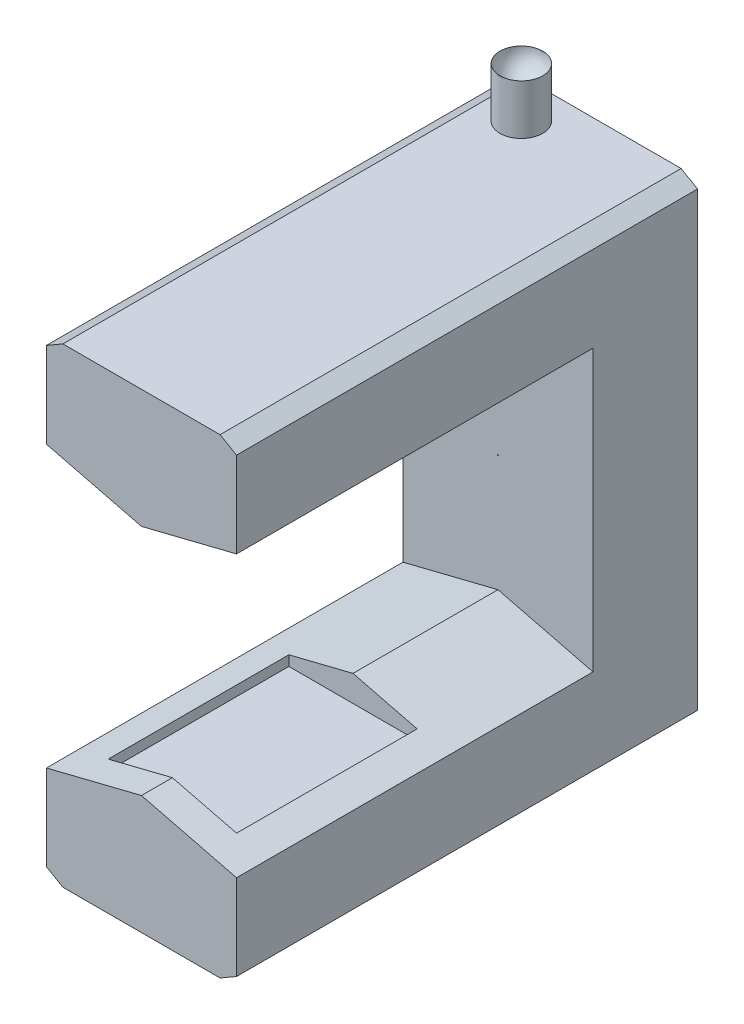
ISO-10303-21;
HEADER;
FILE_DESCRIPTION(('STEP AP214'),'2;1');
FILE_NAME('part.step','',(''),(''),'','','');
FILE_SCHEMA(('AUTOMOTIVE_DESIGN { 1 0 10303 214 1 1 1 1 }'));
ENDSEC;
DATA;
#1=APPLICATION_CONTEXT('core data for automotive mechanical design processes');
#2=APPLICATION_PROTOCOL_DEFINITION('international standard','automotive_design',2000,#1);
#3=PRODUCT_CONTEXT('',#1,'mechanical');
#4=PRODUCT('Part','Part','',(#3));
#5=PRODUCT_RELATED_PRODUCT_CATEGORY('part','',(#4));
#6=PRODUCT_DEFINITION_FORMATION('','',#4);
#7=PRODUCT_DEFINITION_CONTEXT('part definition',#1,'design');
#8=PRODUCT_DEFINITION('design','',#6,#7);
#9=PRODUCT_DEFINITION_SHAPE('','',#8);
#10=(LENGTH_UNIT() NAMED_UNIT(*) SI_UNIT(.MILLI.,.METRE.));
#11=(NAMED_UNIT(*) PLANE_ANGLE_UNIT() SI_UNIT($,.RADIAN.));
#12=(NAMED_UNIT(*) SI_UNIT($,.STERADIAN.) SOLID_ANGLE_UNIT());
#13=UNCERTAINTY_MEASURE_WITH_UNIT(LENGTH_MEASURE(1.E-05),#10,'distance_accuracy_value','');
#14=(GEOMETRIC_REPRESENTATION_CONTEXT(3) GLOBAL_UNCERTAINTY_ASSIGNED_CONTEXT((#13)) GLOBAL_UNIT_ASSIGNED_CONTEXT((#10,
#11,#12)) REPRESENTATION_CONTEXT('',''));
#15=CARTESIAN_POINT('',(0.,0.,0.));
#16=DIRECTION('',(0.,0.,1.));
#17=DIRECTION('',(1.,0.,0.));
#18=AXIS2_PLACEMENT_3D('',#15,#16,#17);
#19=CARTESIAN_POINT('',(0.,30.,0.));
#20=DIRECTION('',(0.,1.,0.));
#21=DIRECTION('',(0.,0.,1.));
#22=AXIS2_PLACEMENT_3D('',#19,#20,#21);
#23=PLANE('',#22);
#24=DIRECTION('',(1.,0.,0.));
#25=VECTOR('',#24,1.);
#26=CARTESIAN_POINT('',(0.,30.,79.5));
#27=LINE('',#26,#25);
#28=CARTESIAN_POINT('',(13.5,30.,79.5));
#29=VERTEX_POINT('',#28);
#30=CARTESIAN_POINT('',(-13.5,30.,79.5));
#31=VERTEX_POINT('',#30);
#32=EDGE_CURVE('E386',#29,#31,#27,.F.);
#33=ORIENTED_EDGE('',*,*,#32,.T.);
#34=DIRECTION('',(0.,0.,1.));
#35=VECTOR('',#34,1.);
#36=CARTESIAN_POINT('',(-13.5,30.,0.));
#37=LINE('',#36,#35);
#38=CARTESIAN_POINT('',(-13.5,30.,41.5));
#39=VERTEX_POINT('',#38);
#40=EDGE_CURVE('E186',#31,#39,#37,.F.);
#41=ORIENTED_EDGE('',*,*,#40,.T.);
#42=DIRECTION('',(-1.,0.,0.));
#43=VECTOR('',#42,1.);
#44=CARTESIAN_POINT('',(0.,30.,41.5));
#45=LINE('',#44,#43);
#46=CARTESIAN_POINT('',(13.5,30.,41.5));
#47=VERTEX_POINT('',#46);
#48=EDGE_CURVE('E349',#39,#47,#45,.F.);
#49=ORIENTED_EDGE('',*,*,#48,.T.);
#50=DIRECTION('',(0.,0.,-1.));
#51=VECTOR('',#50,1.);
#52=CARTESIAN_POINT('',(13.5,30.,0.));
#53=LINE('',#52,#51);
#54=EDGE_CURVE('E348',#47,#29,#53,.F.);
#55=ORIENTED_EDGE('',*,*,#54,.T.);
#56=EDGE_LOOP('',(#33,#41,#49,#55));
#57=FACE_BOUND('',#56,.T.);
#58=ADVANCED_FACE('F16',(#57),#23,.F.);
#59=CARTESIAN_POINT('',(0.,-30.,0.));
#60=DIRECTION('',(0.,1.,0.));
#61=DIRECTION('',(0.,0.,1.));
#62=AXIS2_PLACEMENT_3D('',#59,#60,#61);
#63=PLANE('',#62);
#64=DIRECTION('',(0.,0.,1.));
#65=VECTOR('',#64,1.);
#66=CARTESIAN_POINT('',(-13.5,-30.,0.));
#67=LINE('',#66,#65);
#68=CARTESIAN_POINT('',(-13.5,-30.,41.5));
#69=VERTEX_POINT('',#68);
#70=CARTESIAN_POINT('',(-13.5,-30.,79.5));
#71=VERTEX_POINT('',#70);
#72=EDGE_CURVE('E372',#69,#71,#67,.T.);
#73=ORIENTED_EDGE('',*,*,#72,.T.);
#74=DIRECTION('',(1.,0.,0.));
#75=VECTOR('',#74,1.);
#76=CARTESIAN_POINT('',(0.,-30.,79.5));
#77=LINE('',#76,#75);
#78=CARTESIAN_POINT('',(13.5,-30.,79.5));
#79=VERTEX_POINT('',#78);
#80=EDGE_CURVE('E196',#71,#79,#77,.T.);
#81=ORIENTED_EDGE('',*,*,#80,.T.);
#82=DIRECTION('',(0.,0.,-1.));
#83=VECTOR('',#82,1.);
#84=CARTESIAN_POINT('',(13.5,-30.,0.));
#85=LINE('',#84,#83);
#86=CARTESIAN_POINT('',(13.5,-30.,41.5));
#87=VERTEX_POINT('',#86);
#88=EDGE_CURVE('E382',#79,#87,#85,.T.);
#89=ORIENTED_EDGE('',*,*,#88,.T.);
#90=DIRECTION('',(-1.,0.,0.));
#91=VECTOR('',#90,1.);
#92=CARTESIAN_POINT('',(0.,-30.,41.5));
#93=LINE('',#92,#91);
#94=EDGE_CURVE('E377',#87,#69,#93,.T.);
#95=ORIENTED_EDGE('',*,*,#94,.T.);
#96=EDGE_LOOP('',(#73,#81,#89,#95));
#97=FACE_BOUND('',#96,.T.);
#98=ADVANCED_FACE('F214',(#97),#63,.T.);
#99=CARTESIAN_POINT('',(-8.914602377,60.,-7.337408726));
#100=CARTESIAN_POINT('',(0.085397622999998,60.,-7.337408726));
#101=CARTESIAN_POINT('',(0.085397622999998,60.,1.662591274));
#102=CARTESIAN_POINT('',(-8.914602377,60.,1.662591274));
#103=(BOUNDED_CURVE() B_SPLINE_CURVE(3,(#99,#100,#101,#102),.UNSPECIFIED.,.F.,
.F.) B_SPLINE_CURVE_WITH_KNOTS((4,4),(0.,1.),
.UNSPECIFIED.) CURVE() GEOMETRIC_REPRESENTATION_ITEM() RATIONAL_B_SPLINE_CURVE((1.,
0.333333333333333,0.333333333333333,1.)) REPRESENTATION_ITEM(''));
#104=CARTESIAN_POINT('',(-8.914602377,60.,-2.837408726));
#105=DIRECTION('',(0.,0.,1.));
#106=AXIS1_PLACEMENT('',#104,#105);
#107=SURFACE_OF_REVOLUTION('',#103,#106);
#108=CARTESIAN_POINT('',(-8.914602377,60.,-2.837408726));
#109=DIRECTION('',(0.,-1.,0.));
#110=DIRECTION('',(0.,0.,-1.));
#111=AXIS2_PLACEMENT_3D('',#108,#109,#110);
#112=CIRCLE('',#111,4.5);
#113=CARTESIAN_POINT('',(-8.914602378,60.,-7.337408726));
#114=VERTEX_POINT('',#113);
#115=CARTESIAN_POINT('',(-8.91460237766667,60.,1.662591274));
#116=VERTEX_POINT('',#115);
#117=EDGE_CURVE('E181',#114,#116,#112,.T.);
#118=ORIENTED_EDGE('',*,*,#117,.F.);
#119=CARTESIAN_POINT('',(-8.914602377,60.,-2.837408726));
#120=DIRECTION('',(0.,-1.,0.));
#121=DIRECTION('',(0.,0.,1.));
#122=AXIS2_PLACEMENT_3D('',#119,#120,#121);
#123=CIRCLE('',#122,4.5);
#124=EDGE_CURVE('E185',#116,#114,#123,.T.);
#125=ORIENTED_EDGE('',*,*,#124,.F.);
#126=EDGE_LOOP('',(#118,#125));
#127=FACE_BOUND('',#126,.T.);
#128=ADVANCED_FACE('F184',(#127),#107,.F.);
#129=CARTESIAN_POINT('',(-13.5,0.,0.));
#130=DIRECTION('',(-1.,0.,0.));
#131=DIRECTION('',(0.,0.,1.));
#132=AXIS2_PLACEMENT_3D('',#129,#130,#131);
#133=PLANE('',#132);
#134=DIRECTION('',(0.,1.,0.));
#135=VECTOR('',#134,1.);
#136=CARTESIAN_POINT('',(-13.5,0.,41.5));
#137=LINE('',#136,#135);
#138=CARTESIAN_POINT('',(-13.5000000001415,27.8793679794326,41.5000000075));
#139=VERTEX_POINT('',#138);
#140=EDGE_CURVE('E392',#139,#39,#137,.T.);
#141=ORIENTED_EDGE('',*,*,#140,.T.);
#142=ORIENTED_EDGE('',*,*,#40,.F.);
#143=DIRECTION('',(0.,1.,0.));
#144=VECTOR('',#143,1.);
#145=CARTESIAN_POINT('',(-13.5,0.,79.5));
#146=LINE('',#145,#144);
#147=CARTESIAN_POINT('',(-13.5000000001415,27.8793679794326,79.499999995));
#148=VERTEX_POINT('',#147);
#149=EDGE_CURVE('E384',#31,#148,#146,.F.);
#150=ORIENTED_EDGE('',*,*,#149,.T.);
#151=DIRECTION('',(0.,0.,1.));
#152=VECTOR('',#151,1.);
#153=CARTESIAN_POINT('',(-13.5000000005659,27.8793679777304,0.));
#154=LINE('',#153,#152);
#155=EDGE_CURVE('E362',#139,#148,#154,.T.);
#156=ORIENTED_EDGE('',*,*,#155,.F.);
#157=EDGE_LOOP('',(#141,#142,#150,#156));
#158=FACE_BOUND('',#157,.T.);
#159=ADVANCED_FACE('F213',(#158),#133,.F.);
#160=CARTESIAN_POINT('',(0.,0.,41.5));
#161=DIRECTION('',(0.,0.,-1.));
#162=DIRECTION('',(-1.,0.,0.));
#163=AXIS2_PLACEMENT_3D('',#160,#161,#162);
#164=PLANE('',#163);
#165=DIRECTION('',(-0.970295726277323,-0.241921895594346,0.));
#166=VECTOR('',#165,1.);
#167=CARTESIAN_POINT('',(-5.7541814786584,23.0787613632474,41.50000003));
#168=LINE('',#167,#166);
#169=CARTESIAN_POINT('',(-4.05219496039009E-11,24.5134399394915,41.5000000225));
#170=VERTEX_POINT('',#169);
#171=CARTESIAN_POINT('',(13.5000000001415,27.8793679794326,41.5000000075));
#172=VERTEX_POINT('',#171);
#173=EDGE_CURVE('E333',#170,#172,#168,.F.);
#174=ORIENTED_EDGE('',*,*,#173,.T.);
#175=DIRECTION('',(0.,1.,0.));
#176=VECTOR('',#175,1.);
#177=CARTESIAN_POINT('',(13.5,0.,41.5));
#178=LINE('',#177,#176);
#179=EDGE_CURVE('E336',#172,#47,#178,.T.);
#180=ORIENTED_EDGE('',*,*,#179,.T.);
#181=ORIENTED_EDGE('',*,*,#48,.F.);
#182=ORIENTED_EDGE('',*,*,#140,.F.);
#183=DIRECTION('',(0.970295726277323,-0.241921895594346,0.));
#184=VECTOR('',#183,1.);
#185=CARTESIAN_POINT('',(5.7541814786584,23.0787613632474,41.50000003));
#186=LINE('',#185,#184);
#187=EDGE_CURVE('E339',#170,#139,#186,.F.);
#188=ORIENTED_EDGE('',*,*,#187,.F.);
#189=EDGE_LOOP('',(#174,#180,#181,#182,#188));
#190=FACE_BOUND('',#189,.T.);
#191=ADVANCED_FACE('F323',(#190),#164,.F.);
#192=CARTESIAN_POINT('',(13.5,0.,0.));
#193=DIRECTION('',(1.,0.,0.));
#194=DIRECTION('',(0.,0.,-1.));
#195=AXIS2_PLACEMENT_3D('',#192,#193,#194);
#196=PLANE('',#195);
#197=ORIENTED_EDGE('',*,*,#54,.F.);
#198=ORIENTED_EDGE('',*,*,#179,.F.);
#199=DIRECTION('',(0.,0.,1.));
#200=VECTOR('',#199,1.);
#201=CARTESIAN_POINT('',(13.5000000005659,27.8793679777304,0.));
#202=LINE('',#201,#200);
#203=CARTESIAN_POINT('',(13.5000000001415,27.8793679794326,79.499999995));
#204=VERTEX_POINT('',#203);
#205=EDGE_CURVE('E343',#172,#204,#202,.T.);
#206=ORIENTED_EDGE('',*,*,#205,.T.);
#207=DIRECTION('',(0.,1.,0.));
#208=VECTOR('',#207,1.);
#209=CARTESIAN_POINT('',(13.5,0.,79.5));
#210=LINE('',#209,#208);
#211=EDGE_CURVE('E388',#204,#29,#210,.T.);
#212=ORIENTED_EDGE('',*,*,#211,.T.);
#213=EDGE_LOOP('',(#197,#198,#206,#212));
#214=FACE_BOUND('',#213,.T.);
#215=ADVANCED_FACE('F320',(#214),#196,.F.);
#216=CARTESIAN_POINT('',(0.,0.,79.5));
#217=DIRECTION('',(0.,0.,1.));
#218=DIRECTION('',(1.,0.,0.));
#219=AXIS2_PLACEMENT_3D('',#216,#217,#218);
#220=PLANE('',#219);
#221=ORIENTED_EDGE('',*,*,#149,.F.);
#222=ORIENTED_EDGE('',*,*,#32,.F.);
#223=ORIENTED_EDGE('',*,*,#211,.F.);
#224=DIRECTION('',(-0.970295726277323,-0.241921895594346,0.));
#225=VECTOR('',#224,1.);
#226=CARTESIAN_POINT('',(-5.7541814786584,23.0787613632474,79.4999999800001));
#227=LINE('',#226,#225);
#228=CARTESIAN_POINT('',(7.0073932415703E-12,24.513439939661,79.49999999));
#229=VERTEX_POINT('',#228);
#230=EDGE_CURVE('E353',#204,#229,#227,.T.);
#231=ORIENTED_EDGE('',*,*,#230,.T.);
#232=DIRECTION('',(0.970295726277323,-0.241921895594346,0.));
#233=VECTOR('',#232,1.);
#234=CARTESIAN_POINT('',(5.7541814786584,23.0787613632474,79.4999999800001));
#235=LINE('',#234,#233);
#236=EDGE_CURVE('E190',#148,#229,#235,.T.);
#237=ORIENTED_EDGE('',*,*,#236,.F.);
#238=EDGE_LOOP('',(#221,#222,#223,#231,#237));
#239=FACE_BOUND('',#238,.T.);
#240=ADVANCED_FACE('F316',(#239),#220,.F.);
#241=CARTESIAN_POINT('',(13.5,0.,0.));
#242=DIRECTION('',(1.,0.,0.));
#243=DIRECTION('',(0.,0.,-1.));
#244=AXIS2_PLACEMENT_3D('',#241,#242,#243);
#245=PLANE('',#244);
#246=DIRECTION('',(0.,1.,0.));
#247=VECTOR('',#246,1.);
#248=CARTESIAN_POINT('',(13.5,0.,41.5));
#249=LINE('',#248,#247);
#250=CARTESIAN_POINT('',(13.5000000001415,-27.8793679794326,41.5000000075));
#251=VERTEX_POINT('',#250);
#252=EDGE_CURVE('E379',#251,#87,#249,.F.);
#253=ORIENTED_EDGE('',*,*,#252,.T.);
#254=ORIENTED_EDGE('',*,*,#88,.F.);
#255=DIRECTION('',(0.,1.,0.));
#256=VECTOR('',#255,1.);
#257=CARTESIAN_POINT('',(13.5,0.,79.5));
#258=LINE('',#257,#256);
#259=CARTESIAN_POINT('',(13.5000000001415,-27.8793679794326,79.499999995));
#260=VERTEX_POINT('',#259);
#261=EDGE_CURVE('E191',#79,#260,#258,.T.);
#262=ORIENTED_EDGE('',*,*,#261,.T.);
#263=DIRECTION('',(0.,0.,1.));
#264=VECTOR('',#263,1.);
#265=CARTESIAN_POINT('',(13.5000000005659,-27.8793679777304,0.));
#266=LINE('',#265,#264);
#267=EDGE_CURVE('E480',#251,#260,#266,.T.);
#268=ORIENTED_EDGE('',*,*,#267,.F.);
#269=EDGE_LOOP('',(#253,#254,#262,#268));
#270=FACE_BOUND('',#269,.T.);
#271=ADVANCED_FACE('F312',(#270),#245,.F.);
#272=CARTESIAN_POINT('',(0.,0.,41.5));
#273=DIRECTION('',(0.,0.,-1.));
#274=DIRECTION('',(-1.,0.,0.));
#275=AXIS2_PLACEMENT_3D('',#272,#273,#274);
#276=PLANE('',#275);
#277=DIRECTION('',(0.970295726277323,0.241921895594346,0.));
#278=VECTOR('',#277,1.);
#279=CARTESIAN_POINT('',(5.7541814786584,-23.0787613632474,41.50000003));
#280=LINE('',#279,#278);
#281=CARTESIAN_POINT('',(3.35199125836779E-11,-24.5134399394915,41.5000000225));
#282=VERTEX_POINT('',#281);
#283=CARTESIAN_POINT('',(-13.5000000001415,-27.8793679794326,41.5000000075));
#284=VERTEX_POINT('',#283);
#285=EDGE_CURVE('E473',#282,#284,#280,.F.);
#286=ORIENTED_EDGE('',*,*,#285,.T.);
#287=DIRECTION('',(0.,1.,0.));
#288=VECTOR('',#287,1.);
#289=CARTESIAN_POINT('',(-13.5,0.,41.5));
#290=LINE('',#289,#288);
#291=EDGE_CURVE('E374',#284,#69,#290,.F.);
#292=ORIENTED_EDGE('',*,*,#291,.T.);
#293=ORIENTED_EDGE('',*,*,#94,.F.);
#294=ORIENTED_EDGE('',*,*,#252,.F.);
#295=DIRECTION('',(-0.970295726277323,0.241921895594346,0.));
#296=VECTOR('',#295,1.);
#297=CARTESIAN_POINT('',(-5.7541814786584,-23.0787613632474,41.50000003));
#298=LINE('',#297,#296);
#299=EDGE_CURVE('E483',#282,#251,#298,.F.);
#300=ORIENTED_EDGE('',*,*,#299,.F.);
#301=EDGE_LOOP('',(#286,#292,#293,#294,#300));
#302=FACE_BOUND('',#301,.T.);
#303=ADVANCED_FACE('F308',(#302),#276,.F.);
#304=CARTESIAN_POINT('',(-13.5,0.,0.));
#305=DIRECTION('',(-1.,0.,0.));
#306=DIRECTION('',(0.,0.,1.));
#307=AXIS2_PLACEMENT_3D('',#304,#305,#306);
#308=PLANE('',#307);
#309=ORIENTED_EDGE('',*,*,#72,.F.);
#310=ORIENTED_EDGE('',*,*,#291,.F.);
#311=DIRECTION('',(0.,0.,1.));
#312=VECTOR('',#311,1.);
#313=CARTESIAN_POINT('',(-13.5000000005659,-27.8793679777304,0.));
#314=LINE('',#313,#312);
#315=CARTESIAN_POINT('',(-13.5000000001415,-27.8793679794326,79.499999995));
#316=VERTEX_POINT('',#315);
#317=EDGE_CURVE('E471',#284,#316,#314,.T.);
#318=ORIENTED_EDGE('',*,*,#317,.T.);
#319=DIRECTION('',(0.,1.,0.));
#320=VECTOR('',#319,1.);
#321=CARTESIAN_POINT('',(-13.5,0.,79.5));
#322=LINE('',#321,#320);
#323=EDGE_CURVE('E369',#316,#71,#322,.F.);
#324=ORIENTED_EDGE('',*,*,#323,.T.);
#325=EDGE_LOOP('',(#309,#310,#318,#324));
#326=FACE_BOUND('',#325,.T.);
#327=ADVANCED_FACE('F304',(#326),#308,.F.);
#328=CARTESIAN_POINT('',(0.,0.,79.5));
#329=DIRECTION('',(0.,0.,1.));
#330=DIRECTION('',(1.,0.,0.));
#331=AXIS2_PLACEMENT_3D('',#328,#329,#330);
#332=PLANE('',#331);
#333=ORIENTED_EDGE('',*,*,#261,.F.);
#334=ORIENTED_EDGE('',*,*,#80,.F.);
#335=ORIENTED_EDGE('',*,*,#323,.F.);
#336=DIRECTION('',(0.970295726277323,0.241921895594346,0.));
#337=VECTOR('',#336,1.);
#338=CARTESIAN_POINT('',(5.7541814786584,-23.0787613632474,79.4999999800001));
#339=LINE('',#338,#337);
#340=CARTESIAN_POINT('',(6.99646141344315E-12,-24.513439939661,79.49999999));
#341=VERTEX_POINT('',#340);
#342=EDGE_CURVE('E469',#316,#341,#339,.T.);
#343=ORIENTED_EDGE('',*,*,#342,.T.);
#344=DIRECTION('',(-0.970295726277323,0.241921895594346,0.));
#345=VECTOR('',#344,1.);
#346=CARTESIAN_POINT('',(-5.7541814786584,-23.0787613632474,79.4999999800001));
#347=LINE('',#346,#345);
#348=EDGE_CURVE('E489',#260,#341,#347,.T.);
#349=ORIENTED_EDGE('',*,*,#348,.F.);
#350=EDGE_LOOP('',(#333,#334,#335,#343,#349));
#351=FACE_BOUND('',#350,.T.);
#352=ADVANCED_FACE('F301',(#351),#332,.F.);
#353=CARTESIAN_POINT('',(-8.914602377,60.,-2.837408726));
#354=DIRECTION('',(0.,-1.,0.));
#355=DIRECTION('',(1.,0.,0.));
#356=AXIS2_PLACEMENT_3D('',#353,#354,#355);
#357=CYLINDRICAL_SURFACE('',#356,4.5);
#358=ORIENTED_EDGE('',*,*,#117,.T.);
#359=ORIENTED_EDGE('',*,*,#124,.T.);
#360=EDGE_LOOP('',(#358,#359));
#361=FACE_BOUND('',#360,.T.);
#362=CARTESIAN_POINT('',(-8.91460237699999,49.5,-2.837408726));
#363=DIRECTION('',(0.,-1.,0.));
#364=DIRECTION('',(1.,0.,0.));
#365=AXIS2_PLACEMENT_3D('',#362,#363,#364);
#366=CIRCLE('',#365,4.5);
#367=CARTESIAN_POINT('',(-4.41460237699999,49.5,-2.837408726));
#368=VERTEX_POINT('',#367);
#369=EDGE_CURVE('E19',#368,#368,#366,.F.);
#370=ORIENTED_EDGE('',*,*,#369,.T.);
#371=EDGE_LOOP('',(#370));
#372=FACE_BOUND('',#371,.T.);
#373=ADVANCED_FACE('F188',(#361,#372),#357,.T.);
#374=CARTESIAN_POINT('',(0.,0.,86.));
#375=DIRECTION('',(0.,0.,1.));
#376=DIRECTION('',(1.,0.,0.));
#377=AXIS2_PLACEMENT_3D('',#374,#375,#376);
#378=PLANE('',#377);
#379=DIRECTION('',(0.866025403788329,0.499999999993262,0.));
#380=VECTOR('',#379,1.);
#381=CARTESIAN_POINT('',(-25.5681033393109,44.2852540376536,86.));
#382=LINE('',#381,#380);
#383=CARTESIAN_POINT('',(-16.5358983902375,49.5000000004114,86.));
#384=VERTEX_POINT('',#383);
#385=CARTESIAN_POINT('',(-19.9999999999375,47.4999999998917,86.));
#386=VERTEX_POINT('',#385);
#387=EDGE_CURVE('E455',#384,#386,#382,.F.);
#388=ORIENTED_EDGE('',*,*,#387,.T.);
#389=DIRECTION('',(0.,1.,0.));
#390=VECTOR('',#389,1.);
#391=CARTESIAN_POINT('',(-20.,0.,86.));
#392=LINE('',#391,#390);
#393=CARTESIAN_POINT('',(-20.0000000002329,29.4999999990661,86.));
#394=VERTEX_POINT('',#393);
#395=EDGE_CURVE('E464',#386,#394,#392,.F.);
#396=ORIENTED_EDGE('',*,*,#395,.T.);
#397=DIRECTION('',(0.970295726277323,-0.241921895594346,0.));
#398=VECTOR('',#397,1.);
#399=CARTESIAN_POINT('',(5.7541814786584,23.0787613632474,86.));
#400=LINE('',#399,#398);
#401=CARTESIAN_POINT('',(1.02416963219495E-11,24.513439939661,86.));
#402=VERTEX_POINT('',#401);
#403=EDGE_CURVE('E194',#402,#394,#400,.F.);
#404=ORIENTED_EDGE('',*,*,#403,.F.);
#405=DIRECTION('',(-0.970295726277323,-0.241921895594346,0.));
#406=VECTOR('',#405,1.);
#407=CARTESIAN_POINT('',(-5.7541814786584,23.0787613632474,86.));
#408=LINE('',#407,#406);
#409=CARTESIAN_POINT('',(20.0000000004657,29.5000000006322,86.));
#410=VERTEX_POINT('',#409);
#411=EDGE_CURVE('E360',#402,#410,#408,.F.);
#412=ORIENTED_EDGE('',*,*,#411,.T.);
#413=DIRECTION('',(0.,1.,0.));
#414=VECTOR('',#413,1.);
#415=CARTESIAN_POINT('',(20.,0.,86.));
#416=LINE('',#415,#414);
#417=CARTESIAN_POINT('',(19.9999999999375,47.4999999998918,86.));
#418=VERTEX_POINT('',#417);
#419=EDGE_CURVE('E437',#410,#418,#416,.T.);
#420=ORIENTED_EDGE('',*,*,#419,.T.);
#421=DIRECTION('',(0.866025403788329,-0.499999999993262,0.));
#422=VECTOR('',#421,1.);
#423=CARTESIAN_POINT('',(25.5681033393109,44.2852540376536,86.));
#424=LINE('',#423,#422);
#425=CARTESIAN_POINT('',(16.5358983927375,49.5000000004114,86.));
#426=VERTEX_POINT('',#425);
#427=EDGE_CURVE('E447',#418,#426,#424,.F.);
#428=ORIENTED_EDGE('',*,*,#427,.T.);
#429=DIRECTION('',(1.,0.,0.));
#430=VECTOR('',#429,1.);
#431=CARTESIAN_POINT('',(0.,49.5,86.));
#432=LINE('',#431,#430);
#433=EDGE_CURVE('E451',#426,#384,#432,.F.);
#434=ORIENTED_EDGE('',*,*,#433,.T.);
#435=EDGE_LOOP('',(#388,#396,#404,#412,#420,#428,#434));
#436=FACE_BOUND('',#435,.T.);
#437=ADVANCED_FACE('F294',(#436),#378,.T.);
#438=CARTESIAN_POINT('',(0.,0.,86.));
#439=DIRECTION('',(0.,0.,1.));
#440=DIRECTION('',(1.,0.,0.));
#441=AXIS2_PLACEMENT_3D('',#438,#439,#440);
#442=PLANE('',#441);
#443=DIRECTION('',(-0.866025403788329,-0.499999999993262,0.));
#444=VECTOR('',#443,1.);
#445=CARTESIAN_POINT('',(25.5681033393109,-44.2852540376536,86.));
#446=LINE('',#445,#444);
#447=CARTESIAN_POINT('',(16.5358983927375,-49.5000000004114,86.));
#448=VERTEX_POINT('',#447);
#449=CARTESIAN_POINT('',(19.9999999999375,-47.4999999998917,86.));
#450=VERTEX_POINT('',#449);
#451=EDGE_CURVE('E433',#448,#450,#446,.F.);
#452=ORIENTED_EDGE('',*,*,#451,.T.);
#453=DIRECTION('',(0.,1.,0.));
#454=VECTOR('',#453,1.);
#455=CARTESIAN_POINT('',(20.,0.,86.));
#456=LINE('',#455,#454);
#457=CARTESIAN_POINT('',(20.0000000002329,-29.4999999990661,86.));
#458=VERTEX_POINT('',#457);
#459=EDGE_CURVE('E443',#450,#458,#456,.T.);
#460=ORIENTED_EDGE('',*,*,#459,.T.);
#461=DIRECTION('',(-0.970295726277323,0.241921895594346,0.));
#462=VECTOR('',#461,1.);
#463=CARTESIAN_POINT('',(-5.7541814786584,-23.0787613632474,86.));
#464=LINE('',#463,#462);
#465=CARTESIAN_POINT('',(1.02410965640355E-11,-24.513439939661,86.));
#466=VERTEX_POINT('',#465);
#467=EDGE_CURVE('E486',#466,#458,#464,.F.);
#468=ORIENTED_EDGE('',*,*,#467,.F.);
#469=DIRECTION('',(0.970295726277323,0.241921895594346,0.));
#470=VECTOR('',#469,1.);
#471=CARTESIAN_POINT('',(5.7541814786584,-23.0787613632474,86.));
#472=LINE('',#471,#470);
#473=CARTESIAN_POINT('',(-20.0000000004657,-29.5000000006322,86.));
#474=VERTEX_POINT('',#473);
#475=EDGE_CURVE('E478',#466,#474,#472,.F.);
#476=ORIENTED_EDGE('',*,*,#475,.T.);
#477=DIRECTION('',(0.,1.,0.));
#478=VECTOR('',#477,1.);
#479=CARTESIAN_POINT('',(-20.,0.,86.));
#480=LINE('',#479,#478);
#481=CARTESIAN_POINT('',(-19.9999999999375,-47.4999999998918,86.));
#482=VERTEX_POINT('',#481);
#483=EDGE_CURVE('E457',#474,#482,#480,.F.);
#484=ORIENTED_EDGE('',*,*,#483,.T.);
#485=DIRECTION('',(-0.866025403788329,0.499999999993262,0.));
#486=VECTOR('',#485,1.);
#487=CARTESIAN_POINT('',(-25.5681033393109,-44.2852540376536,86.));
#488=LINE('',#487,#486);
#489=CARTESIAN_POINT('',(-16.5358983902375,-49.5000000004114,86.));
#490=VERTEX_POINT('',#489);
#491=EDGE_CURVE('E422',#482,#490,#488,.F.);
#492=ORIENTED_EDGE('',*,*,#491,.T.);
#493=DIRECTION('',(1.,0.,0.));
#494=VECTOR('',#493,1.);
#495=CARTESIAN_POINT('',(0.,-49.5,86.));
#496=LINE('',#495,#494);
#497=EDGE_CURVE('E429',#490,#448,#496,.T.);
#498=ORIENTED_EDGE('',*,*,#497,.T.);
#499=EDGE_LOOP('',(#452,#460,#468,#476,#484,#492,#498));
#500=FACE_BOUND('',#499,.T.);
#501=ADVANCED_FACE('F290',(#500),#442,.T.);
#502=CARTESIAN_POINT('',(5.7541814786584,23.0787613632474,0.));
#503=DIRECTION('',(-0.241921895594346,-0.970295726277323,0.));
#504=DIRECTION('',(0.970295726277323,-0.241921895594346,0.));
#505=AXIS2_PLACEMENT_3D('',#502,#503,#504);
#506=PLANE('',#505);
#507=ORIENTED_EDGE('',*,*,#187,.T.);
#508=ORIENTED_EDGE('',*,*,#155,.T.);
#509=ORIENTED_EDGE('',*,*,#236,.T.);
#510=DIRECTION('',(0.,0.,1.));
#511=VECTOR('',#510,1.);
#512=CARTESIAN_POINT('',(1.48088138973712E-10,24.513439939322,0.));
#513=LINE('',#512,#511);
#514=EDGE_CURVE('E355',#229,#402,#513,.T.);
#515=ORIENTED_EDGE('',*,*,#514,.T.);
#516=ORIENTED_EDGE('',*,*,#403,.T.);
#517=DIRECTION('',(0.,0.,-1.));
#518=VECTOR('',#517,1.);
#519=CARTESIAN_POINT('',(-20.,29.50000002,0.));
#520=LINE('',#519,#518);
#521=CARTESIAN_POINT('',(-20.0000000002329,29.5000000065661,11.000000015));
#522=VERTEX_POINT('',#521);
#523=EDGE_CURVE('E462',#394,#522,#520,.T.);
#524=ORIENTED_EDGE('',*,*,#523,.T.);
#525=DIRECTION('',(0.970295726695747,-0.241921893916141,0.));
#526=VECTOR('',#525,1.);
#527=CARTESIAN_POINT('',(-20.,29.49999999,11.));
#528=LINE('',#527,#526);
#529=CARTESIAN_POINT('',(-4.21484105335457E-11,24.5134399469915,11.));
#530=VERTEX_POINT('',#529);
#531=EDGE_CURVE('E401',#522,#530,#528,.T.);
#532=ORIENTED_EDGE('',*,*,#531,.T.);
#533=DIRECTION('',(0.,0.,1.));
#534=VECTOR('',#533,1.);
#535=CARTESIAN_POINT('',(1.48088138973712E-10,24.513439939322,0.));
#536=LINE('',#535,#534);
#537=EDGE_CURVE('E344',#530,#170,#536,.T.);
#538=ORIENTED_EDGE('',*,*,#537,.T.);
#539=EDGE_LOOP('',(#507,#508,#509,#515,#516,#524,#532,#538));
#540=FACE_BOUND('',#539,.T.);
#541=ADVANCED_FACE('F286',(#540),#506,.T.);
#542=CARTESIAN_POINT('',(-5.7541814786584,23.0787613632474,0.));
#543=DIRECTION('',(-0.241921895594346,0.970295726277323,0.));
#544=DIRECTION('',(-0.970295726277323,-0.241921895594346,0.));
#545=AXIS2_PLACEMENT_3D('',#542,#543,#544);
#546=PLANE('',#545);
#547=ORIENTED_EDGE('',*,*,#230,.F.);
#548=ORIENTED_EDGE('',*,*,#205,.F.);
#549=ORIENTED_EDGE('',*,*,#173,.F.);
#550=ORIENTED_EDGE('',*,*,#537,.F.);
#551=DIRECTION('',(0.970295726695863,0.241921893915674,0.));
#552=VECTOR('',#551,1.);
#553=CARTESIAN_POINT('',(-2.049915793E-11,24.51343997,11.));
#554=LINE('',#553,#552);
#555=CARTESIAN_POINT('',(20.0000000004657,29.5000000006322,11.0000000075));
#556=VERTEX_POINT('',#555);
#557=EDGE_CURVE('E404',#530,#556,#554,.T.);
#558=ORIENTED_EDGE('',*,*,#557,.T.);
#559=DIRECTION('',(0.,0.,1.));
#560=VECTOR('',#559,1.);
#561=CARTESIAN_POINT('',(20.,29.50000002,0.));
#562=LINE('',#561,#560);
#563=EDGE_CURVE('E439',#556,#410,#562,.T.);
#564=ORIENTED_EDGE('',*,*,#563,.T.);
#565=ORIENTED_EDGE('',*,*,#411,.F.);
#566=ORIENTED_EDGE('',*,*,#514,.F.);
#567=EDGE_LOOP('',(#547,#548,#549,#550,#558,#564,#565,#566));
#568=FACE_BOUND('',#567,.T.);
#569=ADVANCED_FACE('F282',(#568),#546,.F.);
#570=CARTESIAN_POINT('',(-5.7541814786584,-23.0787613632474,0.));
#571=DIRECTION('',(0.241921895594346,0.970295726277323,0.));
#572=DIRECTION('',(-0.970295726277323,0.241921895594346,0.));
#573=AXIS2_PLACEMENT_3D('',#570,#571,#572);
#574=PLANE('',#573);
#575=ORIENTED_EDGE('',*,*,#299,.T.);
#576=ORIENTED_EDGE('',*,*,#267,.T.);
#577=ORIENTED_EDGE('',*,*,#348,.T.);
#578=DIRECTION('',(0.,0.,1.));
#579=VECTOR('',#578,1.);
#580=CARTESIAN_POINT('',(-1.48088138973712E-10,-24.513439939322,0.));
#581=LINE('',#580,#579);
#582=EDGE_CURVE('E466',#341,#466,#581,.T.);
#583=ORIENTED_EDGE('',*,*,#582,.T.);
#584=ORIENTED_EDGE('',*,*,#467,.T.);
#585=DIRECTION('',(0.,0.,1.));
#586=VECTOR('',#585,1.);
#587=CARTESIAN_POINT('',(20.,-29.50000002,0.));
#588=LINE('',#587,#586);
#589=CARTESIAN_POINT('',(20.0000000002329,-29.5000000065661,11.000000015));
#590=VERTEX_POINT('',#589);
#591=EDGE_CURVE('E441',#458,#590,#588,.F.);
#592=ORIENTED_EDGE('',*,*,#591,.T.);
#593=DIRECTION('',(-0.970295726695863,0.241921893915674,0.));
#594=VECTOR('',#593,1.);
#595=CARTESIAN_POINT('',(20.,-29.49999999,11.));
#596=LINE('',#595,#594);
#597=CARTESIAN_POINT('',(3.18996398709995E-11,-24.5134399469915,11.));
#598=VERTEX_POINT('',#597);
#599=EDGE_CURVE('E413',#590,#598,#596,.T.);
#600=ORIENTED_EDGE('',*,*,#599,.T.);
#601=DIRECTION('',(0.,0.,1.));
#602=VECTOR('',#601,1.);
#603=CARTESIAN_POINT('',(-1.48088138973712E-10,-24.513439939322,0.));
#604=LINE('',#603,#602);
#605=EDGE_CURVE('E475',#598,#282,#604,.T.);
#606=ORIENTED_EDGE('',*,*,#605,.T.);
#607=EDGE_LOOP('',(#575,#576,#577,#583,#584,#592,#600,#606));
#608=FACE_BOUND('',#607,.T.);
#609=ADVANCED_FACE('F278',(#608),#574,.T.);
#610=CARTESIAN_POINT('',(5.7541814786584,-23.0787613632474,0.));
#611=DIRECTION('',(0.241921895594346,-0.970295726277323,0.));
#612=DIRECTION('',(0.970295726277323,0.241921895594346,0.));
#613=AXIS2_PLACEMENT_3D('',#610,#611,#612);
#614=PLANE('',#613);
#615=ORIENTED_EDGE('',*,*,#342,.F.);
#616=ORIENTED_EDGE('',*,*,#317,.F.);
#617=ORIENTED_EDGE('',*,*,#285,.F.);
#618=ORIENTED_EDGE('',*,*,#605,.F.);
#619=DIRECTION('',(-0.970295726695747,-0.241921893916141,0.));
#620=VECTOR('',#619,1.);
#621=CARTESIAN_POINT('',(-2.049915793E-11,-24.51343997,11.));
#622=LINE('',#621,#620);
#623=CARTESIAN_POINT('',(-20.0000000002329,-29.5000000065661,11.000000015));
#624=VERTEX_POINT('',#623);
#625=EDGE_CURVE('E514',#598,#624,#622,.T.);
#626=ORIENTED_EDGE('',*,*,#625,.T.);
#627=DIRECTION('',(0.,0.,-1.));
#628=VECTOR('',#627,1.);
#629=CARTESIAN_POINT('',(-20.,-29.50000002,0.));
#630=LINE('',#629,#628);
#631=EDGE_CURVE('E459',#624,#474,#630,.F.);
#632=ORIENTED_EDGE('',*,*,#631,.T.);
#633=ORIENTED_EDGE('',*,*,#475,.F.);
#634=ORIENTED_EDGE('',*,*,#582,.F.);
#635=EDGE_LOOP('',(#615,#616,#617,#618,#626,#632,#633,#634));
#636=FACE_BOUND('',#635,.T.);
#637=ADVANCED_FACE('F274',(#636),#614,.F.);
#638=CARTESIAN_POINT('',(-20.,0.,0.));
#639=DIRECTION('',(1.,0.,0.));
#640=DIRECTION('',(0.,0.,-1.));
#641=AXIS2_PLACEMENT_3D('',#638,#639,#640);
#642=PLANE('',#641);
#643=DIRECTION('',(0.,0.,1.));
#644=VECTOR('',#643,1.);
#645=CARTESIAN_POINT('',(-19.99999999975,-47.499999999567,0.));
#646=LINE('',#645,#644);
#647=CARTESIAN_POINT('',(-19.9999999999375,-47.5000000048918,-11.));
#648=VERTEX_POINT('',#647);
#649=EDGE_CURVE('E424',#648,#482,#646,.T.);
#650=ORIENTED_EDGE('',*,*,#649,.T.);
#651=ORIENTED_EDGE('',*,*,#483,.F.);
#652=ORIENTED_EDGE('',*,*,#631,.F.);
#653=DIRECTION('',(0.,1.,0.));
#654=VECTOR('',#653,1.);
#655=CARTESIAN_POINT('',(-20.,0.,11.));
#656=LINE('',#655,#654);
#657=EDGE_CURVE('E415',#624,#522,#656,.T.);
#658=ORIENTED_EDGE('',*,*,#657,.T.);
#659=ORIENTED_EDGE('',*,*,#523,.F.);
#660=ORIENTED_EDGE('',*,*,#395,.F.);
#661=DIRECTION('',(0.,0.,1.));
#662=VECTOR('',#661,1.);
#663=CARTESIAN_POINT('',(-19.99999999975,47.499999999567,0.));
#664=LINE('',#663,#662);
#665=CARTESIAN_POINT('',(-19.9999999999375,47.5000000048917,-11.));
#666=VERTEX_POINT('',#665);
#667=EDGE_CURVE('E453',#386,#666,#664,.F.);
#668=ORIENTED_EDGE('',*,*,#667,.T.);
#669=DIRECTION('',(0.,1.,0.));
#670=VECTOR('',#669,1.);
#671=CARTESIAN_POINT('',(-20.,0.,-11.));
#672=LINE('',#671,#670);
#673=EDGE_CURVE('E508',#648,#666,#672,.T.);
#674=ORIENTED_EDGE('',*,*,#673,.F.);
#675=EDGE_LOOP('',(#650,#651,#652,#658,#659,#660,#668,#674));
#676=FACE_BOUND('',#675,.T.);
#677=ADVANCED_FACE('F270',(#676),#642,.F.);
#678=CARTESIAN_POINT('',(-25.5681033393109,44.2852540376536,0.));
#679=DIRECTION('',(0.499999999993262,-0.866025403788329,0.));
#680=DIRECTION('',(0.866025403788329,0.499999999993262,0.));
#681=AXIS2_PLACEMENT_3D('',#678,#679,#680);
#682=PLANE('',#681);
#683=ORIENTED_EDGE('',*,*,#667,.F.);
#684=ORIENTED_EDGE('',*,*,#387,.F.);
#685=DIRECTION('',(0.,0.,-1.));
#686=VECTOR('',#685,1.);
#687=CARTESIAN_POINT('',(-16.53589838,49.5,0.));
#688=LINE('',#687,#686);
#689=CARTESIAN_POINT('',(-16.535898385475,49.5000000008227,-11.));
#690=VERTEX_POINT('',#689);
#691=EDGE_CURVE('E449',#384,#690,#688,.T.);
#692=ORIENTED_EDGE('',*,*,#691,.T.);
#693=DIRECTION('',(0.866025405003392,0.499999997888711,0.));
#694=VECTOR('',#693,1.);
#695=CARTESIAN_POINT('',(-20.,47.50000002,-11.));
#696=LINE('',#695,#694);
#697=EDGE_CURVE('E502',#666,#690,#696,.T.);
#698=ORIENTED_EDGE('',*,*,#697,.F.);
#699=EDGE_LOOP('',(#683,#684,#692,#698));
#700=FACE_BOUND('',#699,.T.);
#701=ADVANCED_FACE('F266',(#700),#682,.F.);
#702=CARTESIAN_POINT('',(0.,49.5,0.));
#703=DIRECTION('',(0.,-1.,0.));
#704=DIRECTION('',(0.,0.,-1.));
#705=AXIS2_PLACEMENT_3D('',#702,#703,#704);
#706=PLANE('',#705);
#707=ORIENTED_EDGE('',*,*,#369,.F.);
#708=EDGE_LOOP('',(#707));
#709=FACE_BOUND('',#708,.T.);
#710=ORIENTED_EDGE('',*,*,#691,.F.);
#711=ORIENTED_EDGE('',*,*,#433,.F.);
#712=DIRECTION('',(0.,0.,1.));
#713=VECTOR('',#712,1.);
#714=CARTESIAN_POINT('',(16.53589838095,49.5000000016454,0.));
#715=LINE('',#714,#713);
#716=CARTESIAN_POINT('',(16.5358983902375,49.5000000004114,-11.));
#717=VERTEX_POINT('',#716);
#718=EDGE_CURVE('E445',#426,#717,#715,.F.);
#719=ORIENTED_EDGE('',*,*,#718,.T.);
#720=DIRECTION('',(-1.,0.,0.));
#721=VECTOR('',#720,1.);
#722=CARTESIAN_POINT('',(0.,49.5,-11.));
#723=LINE('',#722,#721);
#724=EDGE_CURVE('E507',#690,#717,#723,.F.);
#725=ORIENTED_EDGE('',*,*,#724,.F.);
#726=EDGE_LOOP('',(#710,#711,#719,#725));
#727=FACE_BOUND('',#726,.T.);
#728=ADVANCED_FACE('F262',(#709,#727),#706,.F.);
#729=CARTESIAN_POINT('',(25.5681033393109,44.2852540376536,0.));
#730=DIRECTION('',(-0.499999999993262,-0.866025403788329,0.));
#731=DIRECTION('',(0.866025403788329,-0.499999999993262,0.));
#732=AXIS2_PLACEMENT_3D('',#729,#730,#731);
#733=PLANE('',#732);
#734=ORIENTED_EDGE('',*,*,#718,.F.);
#735=ORIENTED_EDGE('',*,*,#427,.F.);
#736=DIRECTION('',(0.,0.,1.));
#737=VECTOR('',#736,1.);
#738=CARTESIAN_POINT('',(20.,47.5,0.));
#739=LINE('',#738,#737);
#740=CARTESIAN_POINT('',(19.999999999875,47.5000000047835,-11.));
#741=VERTEX_POINT('',#740);
#742=EDGE_CURVE('E435',#418,#741,#739,.F.);
#743=ORIENTED_EDGE('',*,*,#742,.T.);
#744=DIRECTION('',(0.866025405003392,-0.499999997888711,0.));
#745=VECTOR('',#744,1.);
#746=CARTESIAN_POINT('',(16.5358984,49.5,-11.));
#747=LINE('',#746,#745);
#748=EDGE_CURVE('E546',#717,#741,#747,.T.);
#749=ORIENTED_EDGE('',*,*,#748,.F.);
#750=EDGE_LOOP('',(#734,#735,#743,#749));
#751=FACE_BOUND('',#750,.T.);
#752=ADVANCED_FACE('F258',(#751),#733,.F.);
#753=CARTESIAN_POINT('',(20.,0.,0.));
#754=DIRECTION('',(-1.,0.,0.));
#755=DIRECTION('',(0.,0.,1.));
#756=AXIS2_PLACEMENT_3D('',#753,#754,#755);
#757=PLANE('',#756);
#758=ORIENTED_EDGE('',*,*,#742,.F.);
#759=ORIENTED_EDGE('',*,*,#419,.F.);
#760=ORIENTED_EDGE('',*,*,#563,.F.);
#761=DIRECTION('',(0.,1.,0.));
#762=VECTOR('',#761,1.);
#763=CARTESIAN_POINT('',(20.,0.,11.));
#764=LINE('',#763,#762);
#765=EDGE_CURVE('E411',#556,#590,#764,.F.);
#766=ORIENTED_EDGE('',*,*,#765,.T.);
#767=ORIENTED_EDGE('',*,*,#591,.F.);
#768=ORIENTED_EDGE('',*,*,#459,.F.);
#769=DIRECTION('',(0.,0.,1.));
#770=VECTOR('',#769,1.);
#771=CARTESIAN_POINT('',(19.99999999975,-47.499999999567,0.));
#772=LINE('',#771,#770);
#773=CARTESIAN_POINT('',(19.9999999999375,-47.5000000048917,-11.));
#774=VERTEX_POINT('',#773);
#775=EDGE_CURVE('E431',#450,#774,#772,.F.);
#776=ORIENTED_EDGE('',*,*,#775,.T.);
#777=DIRECTION('',(0.,1.,0.));
#778=VECTOR('',#777,1.);
#779=CARTESIAN_POINT('',(20.,0.,-11.));
#780=LINE('',#779,#778);
#781=EDGE_CURVE('E542',#741,#774,#780,.F.);
#782=ORIENTED_EDGE('',*,*,#781,.F.);
#783=EDGE_LOOP('',(#758,#759,#760,#766,#767,#768,#776,#782));
#784=FACE_BOUND('',#783,.T.);
#785=ADVANCED_FACE('F254',(#784),#757,.F.);
#786=CARTESIAN_POINT('',(25.5681033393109,-44.2852540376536,0.));
#787=DIRECTION('',(-0.499999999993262,0.866025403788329,0.));
#788=DIRECTION('',(-0.866025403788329,-0.499999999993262,0.));
#789=AXIS2_PLACEMENT_3D('',#786,#787,#788);
#790=PLANE('',#789);
#791=ORIENTED_EDGE('',*,*,#775,.F.);
#792=ORIENTED_EDGE('',*,*,#451,.F.);
#793=DIRECTION('',(0.,0.,1.));
#794=VECTOR('',#793,1.);
#795=CARTESIAN_POINT('',(16.53589839,-49.5,0.));
#796=LINE('',#795,#794);
#797=CARTESIAN_POINT('',(16.535898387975,-49.5000000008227,-11.));
#798=VERTEX_POINT('',#797);
#799=EDGE_CURVE('E427',#448,#798,#796,.F.);
#800=ORIENTED_EDGE('',*,*,#799,.T.);
#801=DIRECTION('',(-0.866025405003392,-0.499999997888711,0.));
#802=VECTOR('',#801,1.);
#803=CARTESIAN_POINT('',(20.,-47.50000002,-11.));
#804=LINE('',#803,#802);
#805=EDGE_CURVE('E552',#774,#798,#804,.T.);
#806=ORIENTED_EDGE('',*,*,#805,.F.);
#807=EDGE_LOOP('',(#791,#792,#800,#806));
#808=FACE_BOUND('',#807,.T.);
#809=ADVANCED_FACE('F251',(#808),#790,.F.);
#810=CARTESIAN_POINT('',(0.,-49.5,0.));
#811=DIRECTION('',(0.,1.,0.));
#812=DIRECTION('',(0.,0.,1.));
#813=AXIS2_PLACEMENT_3D('',#810,#811,#812);
#814=PLANE('',#813);
#815=ORIENTED_EDGE('',*,*,#799,.F.);
#816=ORIENTED_EDGE('',*,*,#497,.F.);
#817=DIRECTION('',(0.,0.,1.));
#818=VECTOR('',#817,1.);
#819=CARTESIAN_POINT('',(-16.53589838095,-49.5000000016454,0.));
#820=LINE('',#819,#818);
#821=CARTESIAN_POINT('',(-16.5358983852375,-49.5000000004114,-11.));
#822=VERTEX_POINT('',#821);
#823=EDGE_CURVE('E34',#490,#822,#820,.F.);
#824=ORIENTED_EDGE('',*,*,#823,.T.);
#825=DIRECTION('',(-1.,0.,0.));
#826=VECTOR('',#825,1.);
#827=CARTESIAN_POINT('',(0.,-49.5,-11.));
#828=LINE('',#827,#826);
#829=EDGE_CURVE('E555',#798,#822,#828,.T.);
#830=ORIENTED_EDGE('',*,*,#829,.F.);
#831=EDGE_LOOP('',(#815,#816,#824,#830));
#832=FACE_BOUND('',#831,.T.);
#833=ADVANCED_FACE('F247',(#832),#814,.F.);
#834=CARTESIAN_POINT('',(-25.5681033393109,-44.2852540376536,0.));
#835=DIRECTION('',(0.499999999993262,0.866025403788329,0.));
#836=DIRECTION('',(-0.866025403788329,0.499999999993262,0.));
#837=AXIS2_PLACEMENT_3D('',#834,#835,#836);
#838=PLANE('',#837);
#839=ORIENTED_EDGE('',*,*,#823,.F.);
#840=ORIENTED_EDGE('',*,*,#491,.F.);
#841=ORIENTED_EDGE('',*,*,#649,.F.);
#842=DIRECTION('',(-0.866025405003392,0.499999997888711,0.));
#843=VECTOR('',#842,1.);
#844=CARTESIAN_POINT('',(-16.5358984,-49.5,-11.));
#845=LINE('',#844,#843);
#846=EDGE_CURVE('E512',#822,#648,#845,.T.);
#847=ORIENTED_EDGE('',*,*,#846,.F.);
#848=EDGE_LOOP('',(#839,#840,#841,#847));
#849=FACE_BOUND('',#848,.T.);
#850=ADVANCED_FACE('F243',(#849),#838,.F.);
#851=CARTESIAN_POINT('',(0.,0.,11.));
#852=DIRECTION('',(0.,0.,-1.));
#853=DIRECTION('',(-1.,0.,0.));
#854=AXIS2_PLACEMENT_3D('',#851,#852,#853);
#855=PLANE('',#854);
#856=CARTESIAN_POINT('',(0.,0.,11.));
#857=DIRECTION('',(0.,0.,-1.));
#858=DIRECTION('',(-1.,0.,0.));
#859=AXIS2_PLACEMENT_3D('',#856,#857,#858);
#860=CIRCLE('',#859,0.089301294);
#861=CARTESIAN_POINT('',(-0.0893012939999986,0.,11.));
#862=VERTEX_POINT('',#861);
#863=EDGE_CURVE('E557',#862,#862,#860,.F.);
#864=ORIENTED_EDGE('',*,*,#863,.F.);
#865=EDGE_LOOP('',(#864));
#866=FACE_BOUND('',#865,.T.);
#867=ORIENTED_EDGE('',*,*,#599,.F.);
#868=ORIENTED_EDGE('',*,*,#765,.F.);
#869=ORIENTED_EDGE('',*,*,#557,.F.);
#870=ORIENTED_EDGE('',*,*,#531,.F.);
#871=ORIENTED_EDGE('',*,*,#657,.F.);
#872=ORIENTED_EDGE('',*,*,#625,.F.);
#873=EDGE_LOOP('',(#867,#868,#869,#870,#871,#872));
#874=FACE_BOUND('',#873,.T.);
#875=ADVANCED_FACE('F239',(#866,#874),#855,.F.);
#876=CARTESIAN_POINT('',(0.,0.,-11.));
#877=DIRECTION('',(0.,0.,-1.));
#878=DIRECTION('',(-1.,0.,0.));
#879=AXIS2_PLACEMENT_3D('',#876,#877,#878);
#880=PLANE('',#879);
#881=CARTESIAN_POINT('',(0.,0.,-11.));
#882=DIRECTION('',(0.,0.,-1.));
#883=DIRECTION('',(-1.,0.,0.));
#884=AXIS2_PLACEMENT_3D('',#881,#882,#883);
#885=CIRCLE('',#884,4.25);
#886=CARTESIAN_POINT('',(-4.25,0.,-11.));
#887=VERTEX_POINT('',#886);
#888=EDGE_CURVE('E25',#887,#887,#885,.F.);
#889=ORIENTED_EDGE('',*,*,#888,.T.);
#890=EDGE_LOOP('',(#889));
#891=FACE_BOUND('',#890,.T.);
#892=ORIENTED_EDGE('',*,*,#829,.T.);
#893=ORIENTED_EDGE('',*,*,#846,.T.);
#894=ORIENTED_EDGE('',*,*,#673,.T.);
#895=ORIENTED_EDGE('',*,*,#697,.T.);
#896=ORIENTED_EDGE('',*,*,#724,.T.);
#897=ORIENTED_EDGE('',*,*,#748,.T.);
#898=ORIENTED_EDGE('',*,*,#781,.T.);
#899=ORIENTED_EDGE('',*,*,#805,.T.);
#900=EDGE_LOOP('',(#892,#893,#894,#895,#896,#897,#898,#899));
#901=FACE_BOUND('',#900,.T.);
#902=ADVANCED_FACE('F231',(#891,#901),#880,.T.);
#903=CARTESIAN_POINT('',(0.,0.,11.));
#904=DIRECTION('',(0.,0.,-1.));
#905=DIRECTION('',(-1.,0.,0.));
#906=AXIS2_PLACEMENT_3D('',#903,#904,#905);
#907=CONICAL_SURFACE('',#906,0.089301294,1.02974425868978);
#908=CARTESIAN_POINT('',(0.,0.,8.5));
#909=DIRECTION('',(0.,0.,-1.));
#910=DIRECTION('',(1.,0.,0.));
#911=AXIS2_PLACEMENT_3D('',#908,#909,#910);
#912=CIRCLE('',#911,4.25);
#913=CARTESIAN_POINT('',(-4.25,0.,8.5));
#914=VERTEX_POINT('',#913);
#915=EDGE_CURVE('E10',#914,#914,#912,.T.);
#916=CARTESIAN_POINT('',(-4.25,0.,8.5));
#917=CARTESIAN_POINT('',(-4.20665938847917,0.,8.52604166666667));
#918=CARTESIAN_POINT('',(-4.16331877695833,0.,8.55208333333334));
#919=CARTESIAN_POINT('',(-4.07663755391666,0.,8.60416666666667));
#920=CARTESIAN_POINT('',(-4.03329694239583,0.,8.63020833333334));
#921=CARTESIAN_POINT('',(-3.94661571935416,0.,8.68229166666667));
#922=CARTESIAN_POINT('',(-3.90327510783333,0.,8.70833333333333));
#923=CARTESIAN_POINT('',(-3.81659388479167,0.,8.76041666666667));
#924=CARTESIAN_POINT('',(-3.77325327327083,0.,8.78645833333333));
#925=CARTESIAN_POINT('',(-3.68657205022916,0.,8.83854166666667));
#926=CARTESIAN_POINT('',(-3.64323143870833,0.,8.86458333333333));
#927=CARTESIAN_POINT('',(-3.55655021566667,0.,8.91666666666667));
#928=CARTESIAN_POINT('',(-3.51320960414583,0.,8.94270833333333));
#929=CARTESIAN_POINT('',(-3.42652838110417,0.,8.99479166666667));
#930=CARTESIAN_POINT('',(-3.38318776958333,0.,9.02083333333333));
#931=CARTESIAN_POINT('',(-3.29650654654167,0.,9.07291666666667));
#932=CARTESIAN_POINT('',(-3.25316593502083,0.,9.09895833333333));
#933=CARTESIAN_POINT('',(-3.16648471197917,0.,9.15104166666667));
#934=CARTESIAN_POINT('',(-3.12314410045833,0.,9.17708333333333));
#935=CARTESIAN_POINT('',(-3.03646287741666,0.,9.22916666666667));
#936=CARTESIAN_POINT('',(-2.99312226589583,0.,9.25520833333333));
#937=CARTESIAN_POINT('',(-2.90644104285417,0.,9.30729166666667));
#938=CARTESIAN_POINT('',(-2.86310043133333,0.,9.33333333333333));
#939=CARTESIAN_POINT('',(-2.77641920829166,0.,9.38541666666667));
#940=CARTESIAN_POINT('',(-2.73307859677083,0.,9.41145833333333));
#941=CARTESIAN_POINT('',(-2.64639737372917,0.,9.46354166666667));
#942=CARTESIAN_POINT('',(-2.60305676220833,0.,9.48958333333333));
#943=CARTESIAN_POINT('',(-2.51637553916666,0.,9.54166666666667));
#944=CARTESIAN_POINT('',(-2.47303492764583,0.,9.56770833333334));
#945=CARTESIAN_POINT('',(-2.38635370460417,0.,9.61979166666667));
#946=CARTESIAN_POINT('',(-2.34301309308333,0.,9.64583333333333));
#947=CARTESIAN_POINT('',(-2.25633187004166,0.,9.69791666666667));
#948=CARTESIAN_POINT('',(-2.21299125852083,0.,9.72395833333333));
#949=CARTESIAN_POINT('',(-2.12631003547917,0.,9.77604166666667));
#950=CARTESIAN_POINT('',(-2.08296942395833,0.,9.80208333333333));
#951=CARTESIAN_POINT('',(-1.99628820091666,0.,9.85416666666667));
#952=CARTESIAN_POINT('',(-1.95294758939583,0.,9.88020833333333));
#953=CARTESIAN_POINT('',(-1.86626636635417,0.,9.93229166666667));
#954=CARTESIAN_POINT('',(-1.82292575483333,0.,9.95833333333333));
#955=CARTESIAN_POINT('',(-1.73624453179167,0.,10.0104166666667));
#956=CARTESIAN_POINT('',(-1.69290392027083,0.,10.0364583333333));
#957=CARTESIAN_POINT('',(-1.60622269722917,0.,10.0885416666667));
#958=CARTESIAN_POINT('',(-1.56288208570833,0.,10.1145833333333));
#959=CARTESIAN_POINT('',(-1.47620086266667,0.,10.1666666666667));
#960=CARTESIAN_POINT('',(-1.43286025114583,0.,10.1927083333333));
#961=CARTESIAN_POINT('',(-1.34617902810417,0.,10.2447916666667));
#962=CARTESIAN_POINT('',(-1.30283841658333,0.,10.2708333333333));
#963=CARTESIAN_POINT('',(-1.21615719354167,0.,10.3229166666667));
#964=CARTESIAN_POINT('',(-1.17281658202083,0.,10.3489583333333));
#965=CARTESIAN_POINT('',(-1.08613535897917,0.,10.4010416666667));
#966=CARTESIAN_POINT('',(-1.04279474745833,0.,10.4270833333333));
#967=CARTESIAN_POINT('',(-0.956113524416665,0.,10.4791666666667));
#968=CARTESIAN_POINT('',(-0.912772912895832,0.,10.5052083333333));
#969=CARTESIAN_POINT('',(-0.826091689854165,0.,10.5572916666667));
#970=CARTESIAN_POINT('',(-0.782751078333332,0.,10.5833333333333));
#971=CARTESIAN_POINT('',(-0.696069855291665,0.,10.6354166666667));
#972=CARTESIAN_POINT('',(-0.652729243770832,0.,10.6614583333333));
#973=CARTESIAN_POINT('',(-0.566048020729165,0.,10.7135416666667));
#974=CARTESIAN_POINT('',(-0.522707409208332,0.,10.7395833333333));
#975=CARTESIAN_POINT('',(-0.436026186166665,0.,10.7916666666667));
#976=CARTESIAN_POINT('',(-0.392685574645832,0.,10.8177083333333));
#977=CARTESIAN_POINT('',(-0.306004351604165,0.,10.8697916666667));
#978=CARTESIAN_POINT('',(-0.262663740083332,0.,10.8958333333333));
#979=CARTESIAN_POINT('',(-0.175982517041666,0.,10.9479166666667));
#980=CARTESIAN_POINT('',(-0.132641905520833,0.,10.9739583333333));
#981=CARTESIAN_POINT('',(-0.0893012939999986,0.,11.));
#982=B_SPLINE_CURVE_WITH_KNOTS('',3,(#916,#917,#918,#919,#920,#921,#922,#923,#924,#925,#926,
#927,#928,#929,#930,#931,#932,#933,#934,#935,#936,#937,#938,#939,#940,#941,#942,#943,#944,#945,
#946,#947,#948,#949,#950,#951,#952,#953,#954,#955,#956,#957,#958,#959,#960,#961,#962,#963,#964,
#965,#966,#967,#968,#969,#970,#971,#972,#973,#974,#975,#976,#977,#978,#979,#980,#981),
.UNSPECIFIED.,.F.,.F.,(4,2,2,2,2,2,2,2,2,2,2,2,2,2,2,2,2,2,2,2,2,2,2,2,2,2,2,2,2,2,2,2,4),(0.,
0.151687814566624,0.303375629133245,0.455063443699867,0.606751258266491,0.758439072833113,
0.910126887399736,1.06181470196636,1.21350251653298,1.3651903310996,1.51687814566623,
1.66856596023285,1.82025377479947,1.9719415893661,2.12362940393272,2.27531721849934,
2.42700503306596,2.57869284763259,2.73038066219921,2.88206847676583,3.03375629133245,
3.18544410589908,3.3371319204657,3.48881973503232,3.64050754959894,3.79219536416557,
3.94388317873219,4.09557099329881,4.24725880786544,4.39894662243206,4.55063443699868,
4.7023222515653,4.85401006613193),.UNSPECIFIED.);
#983=EDGE_CURVE('BSEAM225',#914,#862,#982,.T.);
#984=ORIENTED_EDGE('',*,*,#915,.T.);
#985=ORIENTED_EDGE('',*,*,#863,.T.);
#986=ORIENTED_EDGE('',*,*,#983,.T.);
#987=ORIENTED_EDGE('',*,*,#983,.F.);
#988=EDGE_LOOP('',(#984,#986,#985,#987));
#989=FACE_BOUND('',#988,.T.);
#990=ADVANCED_FACE('F225',(#989),#907,.F.);
#991=CARTESIAN_POINT('',(0.,0.,8.5));
#992=DIRECTION('',(0.,0.,-1.));
#993=DIRECTION('',(-1.,0.,0.));
#994=AXIS2_PLACEMENT_3D('',#991,#992,#993);
#995=CYLINDRICAL_SURFACE('',#994,4.25);
#996=ORIENTED_EDGE('',*,*,#888,.F.);
#997=EDGE_LOOP('',(#996));
#998=FACE_BOUND('',#997,.T.);
#999=ORIENTED_EDGE('',*,*,#915,.F.);
#1000=EDGE_LOOP('',(#999));
#1001=FACE_BOUND('',#1000,.T.);
#1002=ADVANCED_FACE('F223',(#998,#1001),#995,.F.);
#1003=CLOSED_SHELL('',(#58,#98,#128,#159,#191,#215,#240,#271,#303,#327,#352,#373,#437,#501,#541,
#569,#609,#637,#677,#701,#728,#752,#785,#809,#833,#850,#875,#902,#990,#1002));
#1004=MANIFOLD_SOLID_BREP('B1',#1003);
#1005=ADVANCED_BREP_SHAPE_REPRESENTATION('',(#18,#1004),#14);
#1006=SHAPE_DEFINITION_REPRESENTATION(#9,#1005);
ENDSEC;
END-ISO-10303-21;
